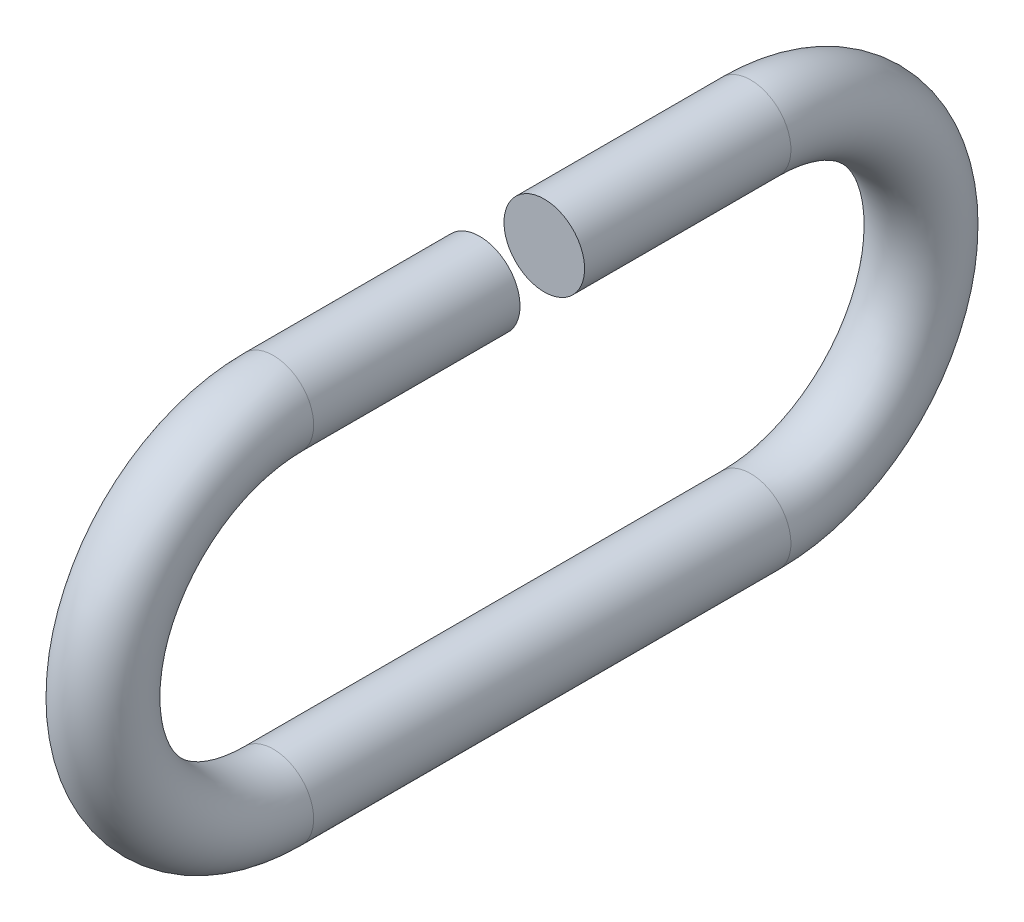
ISO-10303-21;
HEADER;
FILE_DESCRIPTION(('STEP AP214'),'2;1');
FILE_NAME('part.step','',(''),(''),'','','');
FILE_SCHEMA(('AUTOMOTIVE_DESIGN { 1 0 10303 214 1 1 1 1 }'));
ENDSEC;
DATA;
#1=APPLICATION_CONTEXT('core data for automotive mechanical design processes');
#2=APPLICATION_PROTOCOL_DEFINITION('international standard','automotive_design',2000,#1);
#3=PRODUCT_CONTEXT('',#1,'mechanical');
#4=PRODUCT('Part','Part','',(#3));
#5=PRODUCT_RELATED_PRODUCT_CATEGORY('part','',(#4));
#6=PRODUCT_DEFINITION_FORMATION('','',#4);
#7=PRODUCT_DEFINITION_CONTEXT('part definition',#1,'design');
#8=PRODUCT_DEFINITION('design','',#6,#7);
#9=PRODUCT_DEFINITION_SHAPE('','',#8);
#10=(LENGTH_UNIT() NAMED_UNIT(*) SI_UNIT(.MILLI.,.METRE.));
#11=(NAMED_UNIT(*) PLANE_ANGLE_UNIT() SI_UNIT($,.RADIAN.));
#12=(NAMED_UNIT(*) SI_UNIT($,.STERADIAN.) SOLID_ANGLE_UNIT());
#13=UNCERTAINTY_MEASURE_WITH_UNIT(LENGTH_MEASURE(1.E-05),#10,'distance_accuracy_value','');
#14=(GEOMETRIC_REPRESENTATION_CONTEXT(3) GLOBAL_UNCERTAINTY_ASSIGNED_CONTEXT((#13)) GLOBAL_UNIT_ASSIGNED_CONTEXT((#10,
#11,#12)) REPRESENTATION_CONTEXT('',''));
#15=CARTESIAN_POINT('',(0.,0.,0.));
#16=DIRECTION('',(0.,0.,1.));
#17=DIRECTION('',(1.,0.,0.));
#18=AXIS2_PLACEMENT_3D('',#15,#16,#17);
#19=CARTESIAN_POINT('',(0.,8.382,-11.7348));
#20=DIRECTION('',(0.,0.,1.));
#21=DIRECTION('',(0.,-1.,0.));
#22=AXIS2_PLACEMENT_3D('',#19,#20,#21);
#23=CYLINDRICAL_SURFACE('',#22,1.9812);
#24=CARTESIAN_POINT('',(0.,8.382,-1.5875));
#25=DIRECTION('',(0.,0.,-1.));
#26=DIRECTION('',(0.,1.,0.));
#27=AXIS2_PLACEMENT_3D('',#24,#25,#26);
#28=CIRCLE('',#27,1.9812);
#29=CARTESIAN_POINT('',(0.,10.3632,-1.5875));
#30=VERTEX_POINT('',#29);
#31=EDGE_CURVE('E10',#30,#30,#28,.F.);
#32=ORIENTED_EDGE('',*,*,#31,.F.);
#33=EDGE_LOOP('',(#32));
#34=FACE_BOUND('',#33,.T.);
#35=CARTESIAN_POINT('',(0.,8.38199999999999,-11.7348));
#36=DIRECTION('',(0.,0.,1.));
#37=DIRECTION('',(1.,0.,0.));
#38=AXIS2_PLACEMENT_3D('',#35,#36,#37);
#39=CIRCLE('',#38,1.9812);
#40=CARTESIAN_POINT('',(0.,10.3632,-11.7348));
#41=VERTEX_POINT('',#40);
#42=EDGE_CURVE('E40',#41,#41,#39,.T.);
#43=ORIENTED_EDGE('',*,*,#42,.T.);
#44=EDGE_LOOP('',(#43));
#45=FACE_BOUND('',#44,.T.);
#46=ADVANCED_FACE('F30',(#34,#45),#23,.T.);
#47=CARTESIAN_POINT('',(0.,0.,-11.7348));
#48=DIRECTION('',(1.,0.,0.));
#49=DIRECTION('',(0.,0.,-1.));
#50=AXIS2_PLACEMENT_3D('',#47,#48,#49);
#51=TOROIDAL_SURFACE('',#50,8.38199999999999,1.9812);
#52=CARTESIAN_POINT('',(0.,-8.38199999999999,-11.7348));
#53=DIRECTION('',(0.,0.,-1.));
#54=DIRECTION('',(1.,0.,0.));
#55=AXIS2_PLACEMENT_3D('',#52,#53,#54);
#56=CIRCLE('',#55,1.9812);
#57=CARTESIAN_POINT('',(0.,-10.3632,-11.7348));
#58=VERTEX_POINT('',#57);
#59=EDGE_CURVE('E44',#58,#58,#56,.T.);
#60=CARTESIAN_POINT('',(0.,0.,-11.7348));
#61=DIRECTION('',(1.,0.,0.));
#62=DIRECTION('',(0.,0.,-1.));
#63=AXIS2_PLACEMENT_3D('',#60,#61,#62);
#64=CIRCLE('',#63,10.3632);
#65=EDGE_CURVE('',#58,#41,#64,.T.);
#66=ORIENTED_EDGE('',*,*,#59,.T.);
#67=ORIENTED_EDGE('',*,*,#42,.F.);
#68=ORIENTED_EDGE('',*,*,#65,.T.);
#69=ORIENTED_EDGE('',*,*,#65,.F.);
#70=EDGE_LOOP('',(#66,#68,#67,#69));
#71=FACE_BOUND('',#70,.T.);
#72=ADVANCED_FACE('F74',(#71),#51,.T.);
#73=CARTESIAN_POINT('',(0.,-8.38199999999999,11.7348));
#74=DIRECTION('',(0.,0.,-1.));
#75=DIRECTION('',(0.,1.,0.));
#76=AXIS2_PLACEMENT_3D('',#73,#74,#75);
#77=CYLINDRICAL_SURFACE('',#76,1.9812);
#78=ORIENTED_EDGE('',*,*,#59,.F.);
#79=EDGE_LOOP('',(#78));
#80=FACE_BOUND('',#79,.T.);
#81=CARTESIAN_POINT('',(0.,-8.382,11.7348));
#82=DIRECTION('',(0.,0.,-1.));
#83=DIRECTION('',(1.,0.,0.));
#84=AXIS2_PLACEMENT_3D('',#81,#82,#83);
#85=CIRCLE('',#84,1.9812);
#86=CARTESIAN_POINT('',(0.,-10.3632,11.7348));
#87=VERTEX_POINT('',#86);
#88=EDGE_CURVE('E49',#87,#87,#85,.T.);
#89=ORIENTED_EDGE('',*,*,#88,.T.);
#90=EDGE_LOOP('',(#89));
#91=FACE_BOUND('',#90,.T.);
#92=ADVANCED_FACE('F69',(#80,#91),#77,.T.);
#93=CARTESIAN_POINT('',(0.,0.,11.7348));
#94=DIRECTION('',(1.,0.,0.));
#95=DIRECTION('',(0.,0.,-1.));
#96=AXIS2_PLACEMENT_3D('',#93,#94,#95);
#97=TOROIDAL_SURFACE('',#96,8.38199999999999,1.9812);
#98=CARTESIAN_POINT('',(0.,8.38199999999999,11.7348));
#99=DIRECTION('',(0.,0.,1.));
#100=DIRECTION('',(1.,0.,0.));
#101=AXIS2_PLACEMENT_3D('',#98,#99,#100);
#102=CIRCLE('',#101,1.9812);
#103=CARTESIAN_POINT('',(0.,10.3632,11.7348));
#104=VERTEX_POINT('',#103);
#105=EDGE_CURVE('E52',#104,#104,#102,.T.);
#106=CARTESIAN_POINT('',(0.,0.,11.7348));
#107=DIRECTION('',(1.,0.,0.));
#108=DIRECTION('',(0.,0.,-1.));
#109=AXIS2_PLACEMENT_3D('',#106,#107,#108);
#110=CIRCLE('',#109,10.3632);
#111=EDGE_CURVE('',#104,#87,#110,.T.);
#112=ORIENTED_EDGE('',*,*,#105,.T.);
#113=ORIENTED_EDGE('',*,*,#88,.F.);
#114=ORIENTED_EDGE('',*,*,#111,.T.);
#115=ORIENTED_EDGE('',*,*,#111,.F.);
#116=EDGE_LOOP('',(#112,#114,#113,#115));
#117=FACE_BOUND('',#116,.T.);
#118=ADVANCED_FACE('F56',(#117),#97,.T.);
#119=CARTESIAN_POINT('',(0.,8.382,0.));
#120=DIRECTION('',(0.,0.,1.));
#121=DIRECTION('',(0.,-1.,0.));
#122=AXIS2_PLACEMENT_3D('',#119,#120,#121);
#123=CYLINDRICAL_SURFACE('',#122,1.9812);
#124=CARTESIAN_POINT('',(0.,8.382,1.5875));
#125=DIRECTION('',(0.,0.,1.));
#126=DIRECTION('',(0.,-1.,0.));
#127=AXIS2_PLACEMENT_3D('',#124,#125,#126);
#128=CIRCLE('',#127,1.9812);
#129=CARTESIAN_POINT('',(0.,6.4008,1.5875));
#130=VERTEX_POINT('',#129);
#131=EDGE_CURVE('E36',#130,#130,#128,.F.);
#132=ORIENTED_EDGE('',*,*,#131,.F.);
#133=EDGE_LOOP('',(#132));
#134=FACE_BOUND('',#133,.T.);
#135=ORIENTED_EDGE('',*,*,#105,.F.);
#136=EDGE_LOOP('',(#135));
#137=FACE_BOUND('',#136,.T.);
#138=ADVANCED_FACE('F58',(#134,#137),#123,.T.);
#139=CARTESIAN_POINT('',(-1.9812,10.922,1.5875));
#140=DIRECTION('',(0.,0.,1.));
#141=DIRECTION('',(0.,-1.,0.));
#142=AXIS2_PLACEMENT_3D('',#139,#140,#141);
#143=PLANE('',#142);
#144=ORIENTED_EDGE('',*,*,#131,.T.);
#145=EDGE_LOOP('',(#144));
#146=FACE_BOUND('',#145,.T.);
#147=ADVANCED_FACE('F60',(#146),#143,.F.);
#148=CARTESIAN_POINT('',(-1.9812,10.922,-1.5875));
#149=DIRECTION('',(0.,0.,-1.));
#150=DIRECTION('',(0.,1.,0.));
#151=AXIS2_PLACEMENT_3D('',#148,#149,#150);
#152=PLANE('',#151);
#153=ORIENTED_EDGE('',*,*,#31,.T.);
#154=EDGE_LOOP('',(#153));
#155=FACE_BOUND('',#154,.T.);
#156=ADVANCED_FACE('F67',(#155),#152,.F.);
#157=CLOSED_SHELL('',(#46,#72,#92,#118,#138,#147,#156));
#158=MANIFOLD_SOLID_BREP('B2',#157);
#159=ADVANCED_BREP_SHAPE_REPRESENTATION('',(#18,#158),#14);
#160=SHAPE_DEFINITION_REPRESENTATION(#9,#159);
ENDSEC;
END-ISO-10303-21;
